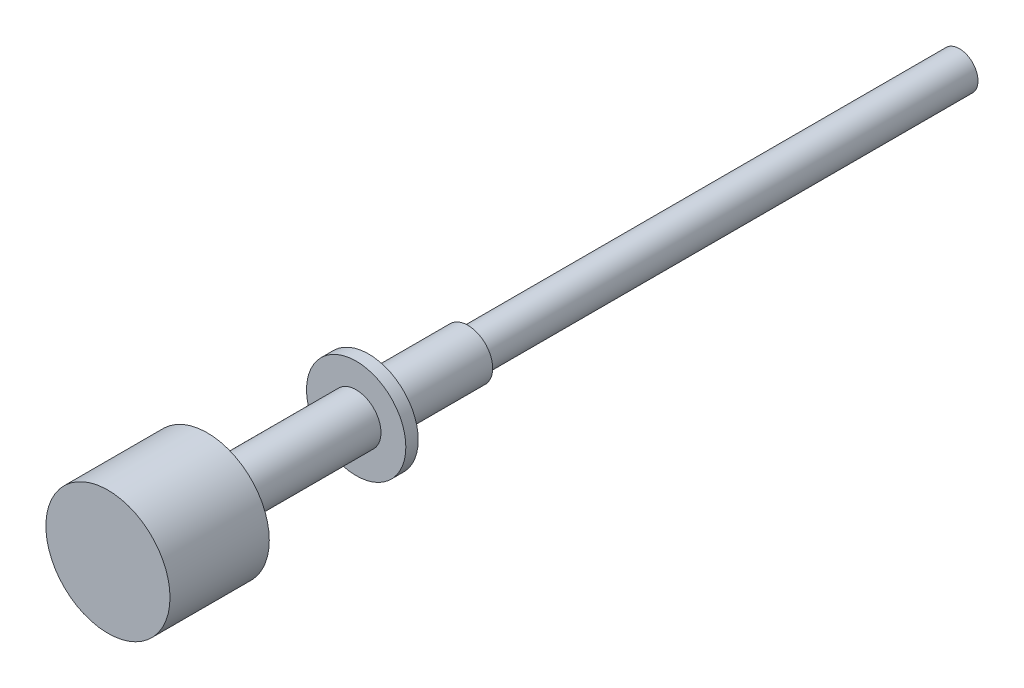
ISO-10303-21;
HEADER;
FILE_DESCRIPTION(('STEP AP214'),'2;1');
FILE_NAME('part.step','',(''),(''),'','','');
FILE_SCHEMA(('AUTOMOTIVE_DESIGN { 1 0 10303 214 1 1 1 1 }'));
ENDSEC;
DATA;
#1=APPLICATION_CONTEXT('core data for automotive mechanical design processes');
#2=APPLICATION_PROTOCOL_DEFINITION('international standard','automotive_design',2000,#1);
#3=PRODUCT_CONTEXT('',#1,'mechanical');
#4=PRODUCT('Part','Part','',(#3));
#5=PRODUCT_RELATED_PRODUCT_CATEGORY('part','',(#4));
#6=PRODUCT_DEFINITION_FORMATION('','',#4);
#7=PRODUCT_DEFINITION_CONTEXT('part definition',#1,'design');
#8=PRODUCT_DEFINITION('design','',#6,#7);
#9=PRODUCT_DEFINITION_SHAPE('','',#8);
#10=(LENGTH_UNIT() NAMED_UNIT(*) SI_UNIT(.MILLI.,.METRE.));
#11=(NAMED_UNIT(*) PLANE_ANGLE_UNIT() SI_UNIT($,.RADIAN.));
#12=(NAMED_UNIT(*) SI_UNIT($,.STERADIAN.) SOLID_ANGLE_UNIT());
#13=UNCERTAINTY_MEASURE_WITH_UNIT(LENGTH_MEASURE(1.E-05),#10,'distance_accuracy_value','');
#14=(GEOMETRIC_REPRESENTATION_CONTEXT(3) GLOBAL_UNCERTAINTY_ASSIGNED_CONTEXT((#13)) GLOBAL_UNIT_ASSIGNED_CONTEXT((#10,
#11,#12)) REPRESENTATION_CONTEXT('',''));
#15=CARTESIAN_POINT('',(0.,0.,0.));
#16=DIRECTION('',(0.,0.,1.));
#17=DIRECTION('',(1.,0.,0.));
#18=AXIS2_PLACEMENT_3D('',#15,#16,#17);
#19=CARTESIAN_POINT('',(0.,0.,125.73));
#20=DIRECTION('',(0.,0.,-1.));
#21=DIRECTION('',(-1.,0.,0.));
#22=AXIS2_PLACEMENT_3D('',#19,#20,#21);
#23=CYLINDRICAL_SURFACE('',#22,4.7625);
#24=CARTESIAN_POINT('',(0.,0.,125.73));
#25=DIRECTION('',(0.,0.,1.));
#26=DIRECTION('',(1.,0.,0.));
#27=AXIS2_PLACEMENT_3D('',#24,#25,#26);
#28=CIRCLE('',#27,4.7625);
#29=CARTESIAN_POINT('',(4.7625,0.,125.73));
#30=VERTEX_POINT('',#29);
#31=EDGE_CURVE('E50',#30,#30,#28,.T.);
#32=ORIENTED_EDGE('',*,*,#31,.F.);
#33=EDGE_LOOP('',(#32));
#34=FACE_BOUND('',#33,.T.);
#35=CARTESIAN_POINT('',(0.,0.,0.));
#36=DIRECTION('',(0.,0.,1.));
#37=DIRECTION('',(1.,0.,0.));
#38=AXIS2_PLACEMENT_3D('',#35,#36,#37);
#39=CIRCLE('',#38,4.7625);
#40=CARTESIAN_POINT('',(4.7625,0.,0.));
#41=VERTEX_POINT('',#40);
#42=EDGE_CURVE('E46',#41,#41,#39,.T.);
#43=ORIENTED_EDGE('',*,*,#42,.T.);
#44=EDGE_LOOP('',(#43));
#45=FACE_BOUND('',#44,.T.);
#46=ADVANCED_FACE('F43',(#34,#45),#23,.T.);
#47=CARTESIAN_POINT('',(0.,0.,0.));
#48=DIRECTION('',(0.,0.,1.));
#49=DIRECTION('',(1.,0.,0.));
#50=AXIS2_PLACEMENT_3D('',#47,#48,#49);
#51=PLANE('',#50);
#52=ORIENTED_EDGE('',*,*,#42,.F.);
#53=EDGE_LOOP('',(#52));
#54=FACE_BOUND('',#53,.T.);
#55=ADVANCED_FACE('F88',(#54),#51,.F.);
#56=CARTESIAN_POINT('',(0.,0.,151.13));
#57=DIRECTION('',(0.,0.,-1.));
#58=DIRECTION('',(-1.,0.,0.));
#59=AXIS2_PLACEMENT_3D('',#56,#57,#58);
#60=CYLINDRICAL_SURFACE('',#59,6.35);
#61=CARTESIAN_POINT('',(0.,0.,151.13));
#62=DIRECTION('',(0.,0.,1.));
#63=DIRECTION('',(1.,0.,0.));
#64=AXIS2_PLACEMENT_3D('',#61,#62,#63);
#65=CIRCLE('',#64,6.35);
#66=CARTESIAN_POINT('',(6.35,0.,151.13));
#67=VERTEX_POINT('',#66);
#68=EDGE_CURVE('E66',#67,#67,#65,.T.);
#69=ORIENTED_EDGE('',*,*,#68,.F.);
#70=EDGE_LOOP('',(#69));
#71=FACE_BOUND('',#70,.T.);
#72=CARTESIAN_POINT('',(0.,0.,125.73));
#73=DIRECTION('',(0.,0.,1.));
#74=DIRECTION('',(1.,0.,0.));
#75=AXIS2_PLACEMENT_3D('',#72,#73,#74);
#76=CIRCLE('',#75,6.35);
#77=CARTESIAN_POINT('',(6.35,0.,125.73));
#78=VERTEX_POINT('',#77);
#79=EDGE_CURVE('E62',#78,#78,#76,.T.);
#80=ORIENTED_EDGE('',*,*,#79,.T.);
#81=EDGE_LOOP('',(#80));
#82=FACE_BOUND('',#81,.T.);
#83=ADVANCED_FACE('F72',(#71,#82),#60,.T.);
#84=CARTESIAN_POINT('',(0.,0.,125.73));
#85=DIRECTION('',(0.,0.,1.));
#86=DIRECTION('',(1.,0.,0.));
#87=AXIS2_PLACEMENT_3D('',#84,#85,#86);
#88=PLANE('',#87);
#89=ORIENTED_EDGE('',*,*,#31,.T.);
#90=EDGE_LOOP('',(#89));
#91=FACE_BOUND('',#90,.T.);
#92=ORIENTED_EDGE('',*,*,#79,.F.);
#93=EDGE_LOOP('',(#92));
#94=FACE_BOUND('',#93,.T.);
#95=ADVANCED_FACE('F74',(#91,#94),#88,.F.);
#96=CARTESIAN_POINT('',(0.,0.,154.305));
#97=DIRECTION('',(0.,0.,-1.));
#98=DIRECTION('',(-1.,0.,0.));
#99=AXIS2_PLACEMENT_3D('',#96,#97,#98);
#100=CYLINDRICAL_SURFACE('',#99,12.7);
#101=CARTESIAN_POINT('',(0.,0.,154.305));
#102=DIRECTION('',(0.,0.,1.));
#103=DIRECTION('',(1.,0.,0.));
#104=AXIS2_PLACEMENT_3D('',#101,#102,#103);
#105=CIRCLE('',#104,12.7);
#106=CARTESIAN_POINT('',(12.7,0.,154.305));
#107=VERTEX_POINT('',#106);
#108=EDGE_CURVE('E59',#107,#107,#105,.T.);
#109=ORIENTED_EDGE('',*,*,#108,.F.);
#110=EDGE_LOOP('',(#109));
#111=FACE_BOUND('',#110,.T.);
#112=CARTESIAN_POINT('',(0.,0.,151.13));
#113=DIRECTION('',(0.,0.,1.));
#114=DIRECTION('',(1.,0.,0.));
#115=AXIS2_PLACEMENT_3D('',#112,#113,#114);
#116=CIRCLE('',#115,12.7);
#117=CARTESIAN_POINT('',(12.7,0.,151.13));
#118=VERTEX_POINT('',#117);
#119=EDGE_CURVE('E63',#118,#118,#116,.T.);
#120=ORIENTED_EDGE('',*,*,#119,.T.);
#121=EDGE_LOOP('',(#120));
#122=FACE_BOUND('',#121,.T.);
#123=ADVANCED_FACE('F76',(#111,#122),#100,.T.);
#124=CARTESIAN_POINT('',(0.,0.,154.305));
#125=DIRECTION('',(0.,0.,1.));
#126=DIRECTION('',(1.,0.,0.));
#127=AXIS2_PLACEMENT_3D('',#124,#125,#126);
#128=PLANE('',#127);
#129=CARTESIAN_POINT('',(0.,0.,154.305));
#130=DIRECTION('',(0.,0.,1.));
#131=DIRECTION('',(1.,0.,0.));
#132=AXIS2_PLACEMENT_3D('',#129,#130,#131);
#133=CIRCLE('',#132,6.35);
#134=CARTESIAN_POINT('',(-6.35,0.,154.305));
#135=VERTEX_POINT('',#134);
#136=EDGE_CURVE('E10',#135,#135,#133,.T.);
#137=ORIENTED_EDGE('',*,*,#136,.F.);
#138=EDGE_LOOP('',(#137));
#139=FACE_BOUND('',#138,.T.);
#140=ORIENTED_EDGE('',*,*,#108,.T.);
#141=EDGE_LOOP('',(#140));
#142=FACE_BOUND('',#141,.T.);
#143=ADVANCED_FACE('F84',(#139,#142),#128,.T.);
#144=CARTESIAN_POINT('',(0.,0.,151.13));
#145=DIRECTION('',(0.,0.,1.));
#146=DIRECTION('',(1.,0.,0.));
#147=AXIS2_PLACEMENT_3D('',#144,#145,#146);
#148=PLANE('',#147);
#149=ORIENTED_EDGE('',*,*,#68,.T.);
#150=EDGE_LOOP('',(#149));
#151=FACE_BOUND('',#150,.T.);
#152=ORIENTED_EDGE('',*,*,#119,.F.);
#153=EDGE_LOOP('',(#152));
#154=FACE_BOUND('',#153,.T.);
#155=ADVANCED_FACE('F135',(#151,#154),#148,.F.);
#156=CARTESIAN_POINT('',(0.,0.,192.405));
#157=DIRECTION('',(0.,0.,-1.));
#158=DIRECTION('',(-1.,0.,0.));
#159=AXIS2_PLACEMENT_3D('',#156,#157,#158);
#160=CYLINDRICAL_SURFACE('',#159,6.35);
#161=CARTESIAN_POINT('',(0.,0.,192.405));
#162=DIRECTION('',(0.,0.,1.));
#163=DIRECTION('',(1.,0.,0.));
#164=AXIS2_PLACEMENT_3D('',#161,#162,#163);
#165=CIRCLE('',#164,6.35);
#166=CARTESIAN_POINT('',(-6.35,0.,192.405));
#167=VERTEX_POINT('',#166);
#168=EDGE_CURVE('E57',#167,#167,#165,.T.);
#169=CARTESIAN_POINT('',(-6.35,0.,192.405));
#170=CARTESIAN_POINT('',(-6.35,0.,192.008125));
#171=CARTESIAN_POINT('',(-6.35,0.,191.61125));
#172=CARTESIAN_POINT('',(-6.35,0.,190.8175));
#173=CARTESIAN_POINT('',(-6.35,0.,190.420625));
#174=CARTESIAN_POINT('',(-6.35,0.,189.626875));
#175=CARTESIAN_POINT('',(-6.35,0.,189.23));
#176=CARTESIAN_POINT('',(-6.35,0.,188.43625));
#177=CARTESIAN_POINT('',(-6.35,0.,188.039375));
#178=CARTESIAN_POINT('',(-6.35,0.,187.245625));
#179=CARTESIAN_POINT('',(-6.35,0.,186.84875));
#180=CARTESIAN_POINT('',(-6.35,0.,186.055));
#181=CARTESIAN_POINT('',(-6.35,0.,185.658125));
#182=CARTESIAN_POINT('',(-6.35,0.,184.864375));
#183=CARTESIAN_POINT('',(-6.35,0.,184.4675));
#184=CARTESIAN_POINT('',(-6.35,0.,183.67375));
#185=CARTESIAN_POINT('',(-6.35,0.,183.276875));
#186=CARTESIAN_POINT('',(-6.35,0.,182.483125));
#187=CARTESIAN_POINT('',(-6.35,0.,182.08625));
#188=CARTESIAN_POINT('',(-6.35,0.,181.2925));
#189=CARTESIAN_POINT('',(-6.35,0.,180.895625));
#190=CARTESIAN_POINT('',(-6.35,0.,180.101875));
#191=CARTESIAN_POINT('',(-6.35,0.,179.705));
#192=CARTESIAN_POINT('',(-6.35,0.,178.91125));
#193=CARTESIAN_POINT('',(-6.35,0.,178.514375));
#194=CARTESIAN_POINT('',(-6.35,0.,177.720625));
#195=CARTESIAN_POINT('',(-6.35,0.,177.32375));
#196=CARTESIAN_POINT('',(-6.35,0.,176.53));
#197=CARTESIAN_POINT('',(-6.35,0.,176.133125));
#198=CARTESIAN_POINT('',(-6.35,0.,175.339375));
#199=CARTESIAN_POINT('',(-6.35,0.,174.9425));
#200=CARTESIAN_POINT('',(-6.35,0.,174.14875));
#201=CARTESIAN_POINT('',(-6.35,0.,173.751875));
#202=CARTESIAN_POINT('',(-6.35,0.,172.958125));
#203=CARTESIAN_POINT('',(-6.35,0.,172.56125));
#204=CARTESIAN_POINT('',(-6.35,0.,171.7675));
#205=CARTESIAN_POINT('',(-6.35,0.,171.370625));
#206=CARTESIAN_POINT('',(-6.35,0.,170.576875));
#207=CARTESIAN_POINT('',(-6.35,0.,170.18));
#208=CARTESIAN_POINT('',(-6.35,0.,169.38625));
#209=CARTESIAN_POINT('',(-6.35,0.,168.989375));
#210=CARTESIAN_POINT('',(-6.35,0.,168.195625));
#211=CARTESIAN_POINT('',(-6.35,0.,167.79875));
#212=CARTESIAN_POINT('',(-6.35,0.,167.005));
#213=CARTESIAN_POINT('',(-6.35,0.,166.608125));
#214=CARTESIAN_POINT('',(-6.35,0.,165.814375));
#215=CARTESIAN_POINT('',(-6.35,0.,165.4175));
#216=CARTESIAN_POINT('',(-6.35,0.,164.62375));
#217=CARTESIAN_POINT('',(-6.35,0.,164.226875));
#218=CARTESIAN_POINT('',(-6.35,0.,163.433125));
#219=CARTESIAN_POINT('',(-6.35,0.,163.03625));
#220=CARTESIAN_POINT('',(-6.35,0.,162.2425));
#221=CARTESIAN_POINT('',(-6.35,0.,161.845625));
#222=CARTESIAN_POINT('',(-6.35,0.,161.051875));
#223=CARTESIAN_POINT('',(-6.35,0.,160.655));
#224=CARTESIAN_POINT('',(-6.35,0.,159.86125));
#225=CARTESIAN_POINT('',(-6.35,0.,159.464375));
#226=CARTESIAN_POINT('',(-6.35,0.,158.670625));
#227=CARTESIAN_POINT('',(-6.35,0.,158.27375));
#228=CARTESIAN_POINT('',(-6.35,0.,157.48));
#229=CARTESIAN_POINT('',(-6.35,0.,157.083125));
#230=CARTESIAN_POINT('',(-6.35,0.,156.289375));
#231=CARTESIAN_POINT('',(-6.35,0.,155.8925));
#232=CARTESIAN_POINT('',(-6.35,0.,155.09875));
#233=CARTESIAN_POINT('',(-6.35,0.,154.701875));
#234=CARTESIAN_POINT('',(-6.35,0.,154.305));
#235=B_SPLINE_CURVE_WITH_KNOTS('',3,(#169,#170,#171,#172,#173,#174,#175,#176,#177,#178,#179,
#180,#181,#182,#183,#184,#185,#186,#187,#188,#189,#190,#191,#192,#193,#194,#195,#196,#197,#198,
#199,#200,#201,#202,#203,#204,#205,#206,#207,#208,#209,#210,#211,#212,#213,#214,#215,#216,#217,
#218,#219,#220,#221,#222,#223,#224,#225,#226,#227,#228,#229,#230,#231,#232,#233,#234),
.UNSPECIFIED.,.F.,.F.,(4,2,2,2,2,2,2,2,2,2,2,2,2,2,2,2,2,2,2,2,2,2,2,2,2,2,2,2,2,2,2,2,4),(0.,
1.190625,2.38125,3.571875,4.7625,5.953125,7.14375,8.334375,9.52500000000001,10.715625,11.90625,
13.096875,14.2875,15.478125,16.66875,17.859375,19.05,20.240625,21.43125,22.621875,23.8125,
25.003125,26.19375,27.384375,28.575,29.765625,30.95625,32.146875,33.3375,34.528125,35.71875,
36.909375,38.1),.UNSPECIFIED.);
#236=EDGE_CURVE('BSEAM140',#167,#135,#235,.T.);
#237=ORIENTED_EDGE('',*,*,#168,.F.);
#238=ORIENTED_EDGE('',*,*,#136,.T.);
#239=ORIENTED_EDGE('',*,*,#236,.T.);
#240=ORIENTED_EDGE('',*,*,#236,.F.);
#241=EDGE_LOOP('',(#237,#239,#238,#240));
#242=FACE_BOUND('',#241,.T.);
#243=ADVANCED_FACE('F140',(#242),#160,.T.);
#244=CARTESIAN_POINT('',(0.,0.,217.805));
#245=DIRECTION('',(0.,0.,-1.));
#246=DIRECTION('',(-1.,0.,0.));
#247=AXIS2_PLACEMENT_3D('',#244,#245,#246);
#248=CYLINDRICAL_SURFACE('',#247,15.875);
#249=CARTESIAN_POINT('',(0.,0.,217.805));
#250=DIRECTION('',(0.,0.,1.));
#251=DIRECTION('',(1.,0.,0.));
#252=AXIS2_PLACEMENT_3D('',#249,#250,#251);
#253=CIRCLE('',#252,15.875);
#254=CARTESIAN_POINT('',(15.875,0.,217.805));
#255=VERTEX_POINT('',#254);
#256=EDGE_CURVE('E247',#255,#255,#253,.T.);
#257=ORIENTED_EDGE('',*,*,#256,.F.);
#258=EDGE_LOOP('',(#257));
#259=FACE_BOUND('',#258,.T.);
#260=CARTESIAN_POINT('',(0.,0.,192.405));
#261=DIRECTION('',(0.,0.,1.));
#262=DIRECTION('',(1.,0.,0.));
#263=AXIS2_PLACEMENT_3D('',#260,#261,#262);
#264=CIRCLE('',#263,15.875);
#265=CARTESIAN_POINT('',(15.875,0.,192.405));
#266=VERTEX_POINT('',#265);
#267=EDGE_CURVE('E245',#266,#266,#264,.T.);
#268=ORIENTED_EDGE('',*,*,#267,.T.);
#269=EDGE_LOOP('',(#268));
#270=FACE_BOUND('',#269,.T.);
#271=ADVANCED_FACE('F164',(#259,#270),#248,.T.);
#272=CARTESIAN_POINT('',(0.,0.,217.805));
#273=DIRECTION('',(0.,0.,1.));
#274=DIRECTION('',(1.,0.,0.));
#275=AXIS2_PLACEMENT_3D('',#272,#273,#274);
#276=PLANE('',#275);
#277=ORIENTED_EDGE('',*,*,#256,.T.);
#278=EDGE_LOOP('',(#277));
#279=FACE_BOUND('',#278,.T.);
#280=ADVANCED_FACE('F177',(#279),#276,.T.);
#281=CARTESIAN_POINT('',(0.,0.,192.405));
#282=DIRECTION('',(0.,0.,1.));
#283=DIRECTION('',(1.,0.,0.));
#284=AXIS2_PLACEMENT_3D('',#281,#282,#283);
#285=PLANE('',#284);
#286=ORIENTED_EDGE('',*,*,#168,.T.);
#287=EDGE_LOOP('',(#286));
#288=FACE_BOUND('',#287,.T.);
#289=ORIENTED_EDGE('',*,*,#267,.F.);
#290=EDGE_LOOP('',(#289));
#291=FACE_BOUND('',#290,.T.);
#292=ADVANCED_FACE('F190',(#288,#291),#285,.F.);
#293=CLOSED_SHELL('',(#46,#55,#83,#95,#123,#143,#155,#243,#271,#280,#292));
#294=MANIFOLD_SOLID_BREP('B2',#293);
#295=ADVANCED_BREP_SHAPE_REPRESENTATION('',(#18,#294),#14);
#296=SHAPE_DEFINITION_REPRESENTATION(#9,#295);
ENDSEC;
END-ISO-10303-21;
